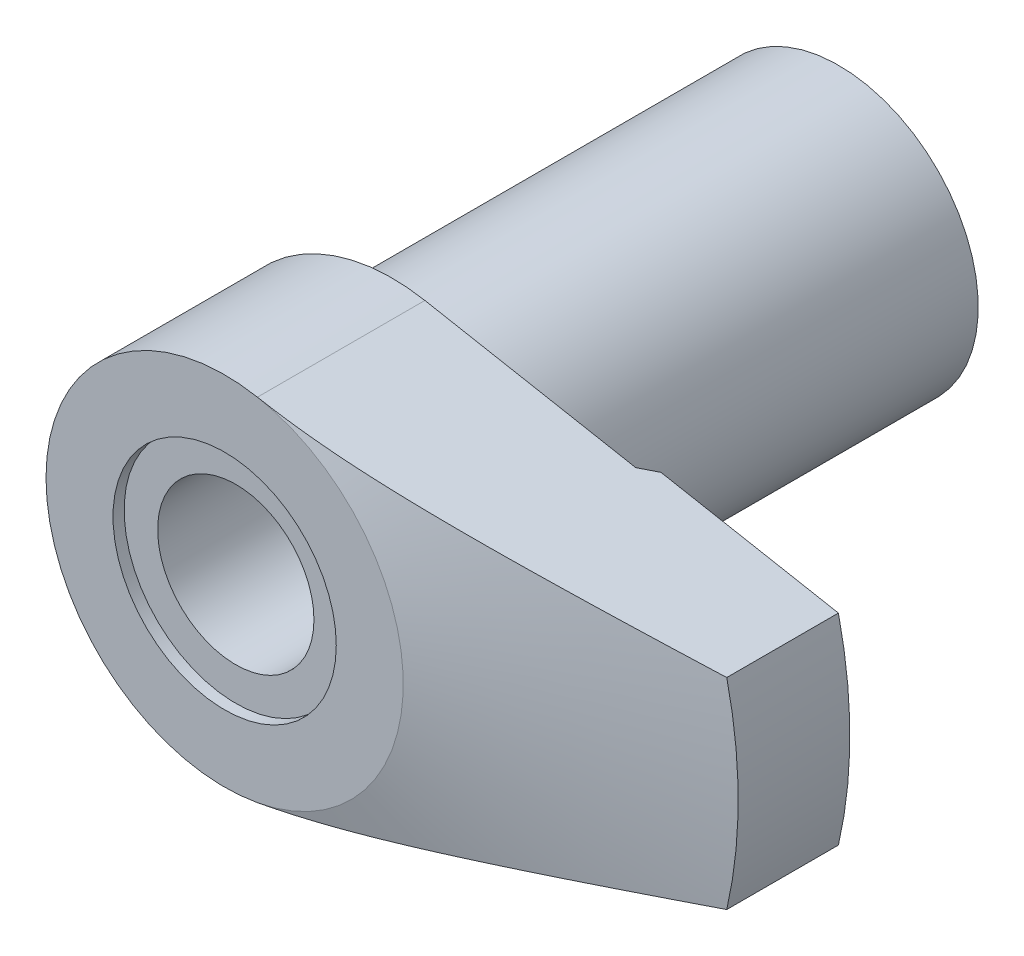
ISO-10303-21;
HEADER;
FILE_DESCRIPTION(('STEP AP214'),'2;1');
FILE_NAME('part.step','',(''),(''),'','','');
FILE_SCHEMA(('AUTOMOTIVE_DESIGN { 1 0 10303 214 1 1 1 1 }'));
ENDSEC;
DATA;
#1=APPLICATION_CONTEXT('core data for automotive mechanical design processes');
#2=APPLICATION_PROTOCOL_DEFINITION('international standard','automotive_design',2000,#1);
#3=PRODUCT_CONTEXT('',#1,'mechanical');
#4=PRODUCT('Part','Part','',(#3));
#5=PRODUCT_RELATED_PRODUCT_CATEGORY('part','',(#4));
#6=PRODUCT_DEFINITION_FORMATION('','',#4);
#7=PRODUCT_DEFINITION_CONTEXT('part definition',#1,'design');
#8=PRODUCT_DEFINITION('design','',#6,#7);
#9=PRODUCT_DEFINITION_SHAPE('','',#8);
#10=(LENGTH_UNIT() NAMED_UNIT(*) SI_UNIT(.MILLI.,.METRE.));
#11=(NAMED_UNIT(*) PLANE_ANGLE_UNIT() SI_UNIT($,.RADIAN.));
#12=(NAMED_UNIT(*) SI_UNIT($,.STERADIAN.) SOLID_ANGLE_UNIT());
#13=UNCERTAINTY_MEASURE_WITH_UNIT(LENGTH_MEASURE(1.E-05),#10,'distance_accuracy_value','');
#14=(GEOMETRIC_REPRESENTATION_CONTEXT(3) GLOBAL_UNCERTAINTY_ASSIGNED_CONTEXT((#13)) GLOBAL_UNIT_ASSIGNED_CONTEXT((#10,
#11,#12)) REPRESENTATION_CONTEXT('',''));
#15=CARTESIAN_POINT('',(0.,0.,0.));
#16=DIRECTION('',(0.,0.,1.));
#17=DIRECTION('',(1.,0.,0.));
#18=AXIS2_PLACEMENT_3D('',#15,#16,#17);
#19=CARTESIAN_POINT('',(38.9743505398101,9.,55.));
#20=DIRECTION('',(-0.183527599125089,-0.983014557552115,0.));
#21=DIRECTION('',(0.983014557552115,-0.183527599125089,0.));
#22=AXIS2_PLACEMENT_3D('',#19,#20,#21);
#23=PLANE('',#22);
#24=DIRECTION('',(0.983014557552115,-0.183527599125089,0.));
#25=VECTOR('',#24,1.);
#26=CARTESIAN_POINT('',(2.93644158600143,15.7282329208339,40.));
#27=LINE('',#26,#25);
#28=CARTESIAN_POINT('',(2.93644158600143,15.7282329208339,40.));
#29=VERTEX_POINT('',#28);
#30=CARTESIAN_POINT('',(21.8195346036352,12.2027828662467,40.));
#31=VERTEX_POINT('',#30);
#32=EDGE_CURVE('E73',#29,#31,#27,.T.);
#33=ORIENTED_EDGE('',*,*,#32,.F.);
#34=DIRECTION('',(0.,0.,-1.));
#35=VECTOR('',#34,1.);
#36=CARTESIAN_POINT('',(2.93644158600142,15.7282329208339,55.));
#37=LINE('',#36,#35);
#38=CARTESIAN_POINT('',(2.93644158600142,15.7282329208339,55.));
#39=VERTEX_POINT('',#38);
#40=EDGE_CURVE('E160',#39,#29,#37,.T.);
#41=ORIENTED_EDGE('',*,*,#40,.F.);
#42=CARTESIAN_POINT('',(2.93624158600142,15.7282702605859,54.9999999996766));
#43=CARTESIAN_POINT('',(3.27198005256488,15.6655883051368,55.0000135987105));
#44=CARTESIAN_POINT('',(3.60771690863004,15.6029066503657,54.9972684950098));
#45=CARTESIAN_POINT('',(4.27909896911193,15.4775604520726,54.9863525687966));
#46=CARTESIAN_POINT('',(4.61474417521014,15.4148959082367,54.9781818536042));
#47=CARTESIAN_POINT('',(5.28578738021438,15.2896129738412,54.9565089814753));
#48=CARTESIAN_POINT('',(5.62118541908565,15.2269945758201,54.9430081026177));
#49=CARTESIAN_POINT('',(6.29174105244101,15.1018026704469,54.910851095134));
#50=CARTESIAN_POINT('',(6.62689864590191,15.0392291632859,54.8921949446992));
#51=CARTESIAN_POINT('',(7.63088618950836,14.8517859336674,54.8288811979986));
#52=CARTESIAN_POINT('',(8.29927611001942,14.7269983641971,54.7768432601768));
#53=CARTESIAN_POINT('',(9.63452756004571,14.4777085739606,54.6552798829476));
#54=CARTESIAN_POINT('',(10.3013889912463,14.3532063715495,54.5857533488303));
#55=CARTESIAN_POINT('',(11.6317544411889,14.1048287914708,54.4318940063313));
#56=CARTESIAN_POINT('',(12.2952626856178,13.9809526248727,54.3475986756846));
#57=CARTESIAN_POINT('',(13.6206011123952,13.7335135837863,54.1664787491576));
#58=CARTESIAN_POINT('',(14.2824313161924,13.6099507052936,54.0696543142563));
#59=CARTESIAN_POINT('',(15.604824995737,13.3630614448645,53.8655820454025));
#60=CARTESIAN_POINT('',(16.2653877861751,13.2397351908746,53.7583296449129));
#61=CARTESIAN_POINT('',(17.5851193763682,12.9933429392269,53.5352726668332));
#62=CARTESIAN_POINT('',(18.244288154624,12.8702769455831,53.4194679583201));
#63=CARTESIAN_POINT('',(19.7431177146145,12.5904473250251,53.1479184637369));
#64=CARTESIAN_POINT('',(20.5823917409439,12.4337559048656,52.9899704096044));
#65=CARTESIAN_POINT('',(22.259269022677,12.1206849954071,52.6651711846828));
#66=CARTESIAN_POINT('',(23.0968722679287,11.9643055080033,52.4983199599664));
#67=CARTESIAN_POINT('',(24.7705715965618,11.6518279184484,52.1576412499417));
#68=CARTESIAN_POINT('',(25.6066678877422,11.4957297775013,51.9838148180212));
#69=CARTESIAN_POINT('',(27.2777257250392,11.1837453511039,51.6306071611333));
#70=CARTESIAN_POINT('',(28.1126872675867,11.0278590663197,51.4512259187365));
#71=CARTESIAN_POINT('',(29.7842993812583,10.7157711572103,51.0874381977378));
#72=CARTESIAN_POINT('',(30.6209469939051,10.5595700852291,50.903017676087));
#73=CARTESIAN_POINT('',(32.2934616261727,10.2473136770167,50.5305455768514));
#74=CARTESIAN_POINT('',(33.1293286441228,10.0912583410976,50.3424939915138));
#75=CARTESIAN_POINT('',(34.8004037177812,9.77927069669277,49.9634277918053));
#76=CARTESIAN_POINT('',(35.6356117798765,9.62333838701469,49.7724132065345));
#77=CARTESIAN_POINT('',(37.3054715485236,9.31157763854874,49.3879134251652));
#78=CARTESIAN_POINT('',(38.1401232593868,9.15574919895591,49.1944282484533));
#79=CARTESIAN_POINT('',(38.9745505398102,8.99996266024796,48.9999533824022));
#80=B_SPLINE_CURVE_WITH_KNOTS('',3,(#42,#43,#44,#45,#46,#47,#48,#49,#50,#51,#52,#53,#54,#55,#56,
#57,#58,#59,#60,#61,#62,#63,#64,#65,#66,#67,#68,#69,#70,#71,#72,#73,#74,#75,#76,#77,#78,#79),
.UNSPECIFIED.,.F.,.F.,(4,2,2,2,2,2,2,2,2,2,2,2,2,2,2,2,2,2,4),(0.,1.02460521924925,
2.04919017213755,3.07352959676,4.09787335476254,6.14337060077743,8.18899591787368,
10.2295034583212,12.2699847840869,14.3113637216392,16.3527739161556,18.9574987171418,
21.5622392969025,24.1665879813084,26.7709448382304,29.383501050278,31.9960628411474,
34.6085989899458,37.2211146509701),.UNSPECIFIED.);
#81=CARTESIAN_POINT('',(38.9743505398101,9.,49.));
#82=VERTEX_POINT('',#81);
#83=EDGE_CURVE('E135',#39,#82,#80,.T.);
#84=ORIENTED_EDGE('',*,*,#83,.T.);
#85=DIRECTION('',(0.,0.,-1.));
#86=VECTOR('',#85,1.);
#87=CARTESIAN_POINT('',(38.9743505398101,9.,55.));
#88=LINE('',#87,#86);
#89=CARTESIAN_POINT('',(38.9743505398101,9.,39.));
#90=VERTEX_POINT('',#89);
#91=EDGE_CURVE('E163',#82,#90,#88,.T.);
#92=ORIENTED_EDGE('',*,*,#91,.T.);
#93=DIRECTION('',(-0.983014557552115,0.183527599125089,0.));
#94=VECTOR('',#93,1.);
#95=CARTESIAN_POINT('',(38.9743505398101,9.,39.));
#96=LINE('',#95,#94);
#97=CARTESIAN_POINT('',(23.0822451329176,11.9670363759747,39.));
#98=VERTEX_POINT('',#97);
#99=EDGE_CURVE('E148',#90,#98,#96,.T.);
#100=ORIENTED_EDGE('',*,*,#99,.T.);
#101=CARTESIAN_POINT('',(-12.1892639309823,18.5521833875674,42.8017644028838));
#102=CARTESIAN_POINT('',(-11.9716131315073,18.5115482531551,42.9552352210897));
#103=CARTESIAN_POINT('',(-11.7531749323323,18.4707661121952,43.1075492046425));
#104=CARTESIAN_POINT('',(-11.3145923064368,18.3888832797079,43.4096307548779));
#105=CARTESIAN_POINT('',(-11.0944478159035,18.3477825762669,43.5593982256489));
#106=CARTESIAN_POINT('',(-10.4310764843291,18.2239319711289,44.0046527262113));
#107=CARTESIAN_POINT('',(-9.98511427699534,18.1406713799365,44.2959484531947));
#108=CARTESIAN_POINT('',(-9.07888967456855,17.9714803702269,44.8687270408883));
#109=CARTESIAN_POINT('',(-8.61851605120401,17.8855291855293,45.1500284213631));
#110=CARTESIAN_POINT('',(-7.68806849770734,17.7118157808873,45.6954613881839));
#111=CARTESIAN_POINT('',(-7.21799577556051,17.6240537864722,45.9595950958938));
#112=CARTESIAN_POINT('',(-6.25356224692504,17.4439952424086,46.4737867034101));
#113=CARTESIAN_POINT('',(-5.75888985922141,17.3516405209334,46.7232441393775));
#114=CARTESIAN_POINT('',(-4.75666121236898,17.1645256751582,47.1943149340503));
#115=CARTESIAN_POINT('',(-4.24910261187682,17.0697651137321,47.4159231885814));
#116=CARTESIAN_POINT('',(-3.22328192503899,16.8782456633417,47.8234099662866));
#117=CARTESIAN_POINT('',(-2.70509080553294,16.7815000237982,48.0094715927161));
#118=CARTESIAN_POINT('',(-1.65600675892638,16.5856373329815,48.3395993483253));
#119=CARTESIAN_POINT('',(-1.12512218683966,16.486521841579,48.4836923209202));
#120=CARTESIAN_POINT('',(-0.333478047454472,16.3387228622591,48.6598476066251));
#121=CARTESIAN_POINT('',(-0.0767622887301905,16.2907943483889,48.7110738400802));
#122=CARTESIAN_POINT('',(0.438688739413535,16.1945602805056,48.8015554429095));
#123=CARTESIAN_POINT('',(0.697423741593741,16.1462547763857,48.8408123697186));
#124=CARTESIAN_POINT('',(1.21654205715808,16.0493360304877,48.9067562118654));
#125=CARTESIAN_POINT('',(1.47692596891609,16.000722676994,48.933438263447));
#126=CARTESIAN_POINT('',(1.99867646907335,15.903312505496,48.9737701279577));
#127=CARTESIAN_POINT('',(2.26004306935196,15.8545156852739,48.9874197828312));
#128=CARTESIAN_POINT('',(2.77969423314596,15.7574974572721,49.0013585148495));
#129=CARTESIAN_POINT('',(3.03797431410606,15.7092768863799,49.0018202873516));
#130=CARTESIAN_POINT('',(3.55427147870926,15.6128848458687,48.9898133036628));
#131=CARTESIAN_POINT('',(3.81228852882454,15.5647133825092,48.9773430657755));
#132=CARTESIAN_POINT('',(4.32739660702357,15.4685433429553,48.9396786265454));
#133=CARTESIAN_POINT('',(4.58448772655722,15.4205447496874,48.9144857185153));
#134=CARTESIAN_POINT('',(5.0972267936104,15.3248170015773,48.8517917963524));
#135=CARTESIAN_POINT('',(5.35287455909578,15.2770878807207,48.8142892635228));
#136=CARTESIAN_POINT('',(6.11354932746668,15.1350708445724,48.6847083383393));
#137=CARTESIAN_POINT('',(6.61579008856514,15.0413031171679,48.5752881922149));
#138=CARTESIAN_POINT('',(7.60986358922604,14.8557108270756,48.31579057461));
#139=CARTESIAN_POINT('',(8.10169532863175,14.7638864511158,48.1657092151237));
#140=CARTESIAN_POINT('',(8.83269046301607,14.6274105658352,47.9142591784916));
#141=CARTESIAN_POINT('',(9.07619164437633,14.581949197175,47.8256459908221));
#142=CARTESIAN_POINT('',(9.5602738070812,14.4915716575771,47.6404944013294));
#143=CARTESIAN_POINT('',(9.80085477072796,14.4466554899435,47.5439559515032));
#144=CARTESIAN_POINT('',(10.2790455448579,14.3573778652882,47.3437280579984));
#145=CARTESIAN_POINT('',(10.5166560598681,14.3130162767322,47.2400403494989));
#146=CARTESIAN_POINT('',(10.9890224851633,14.2248260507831,47.0261849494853));
#147=CARTESIAN_POINT('',(11.2237784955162,14.1809973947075,46.9160174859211));
#148=CARTESIAN_POINT('',(11.9748909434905,14.0407656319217,46.5520620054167));
#149=CARTESIAN_POINT('',(12.4859028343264,13.9453603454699,46.2868093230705));
#150=CARTESIAN_POINT('',(13.4958766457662,13.7567994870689,45.7334260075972));
#151=CARTESIAN_POINT('',(13.9948347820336,13.6636446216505,45.4452883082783));
#152=CARTESIAN_POINT('',(14.9826537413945,13.4792200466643,44.8504305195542));
#153=CARTESIAN_POINT('',(15.4715024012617,13.3879526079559,44.5436896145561));
#154=CARTESIAN_POINT('',(16.4398875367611,13.20715630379,43.9155277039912));
#155=CARTESIAN_POINT('',(16.9194249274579,13.1176272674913,43.5941081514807));
#156=CARTESIAN_POINT('',(17.8724548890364,12.9396977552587,42.9379831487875));
#157=CARTESIAN_POINT('',(18.3459149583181,12.8513033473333,42.6032289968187));
#158=CARTESIAN_POINT('',(19.2859224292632,12.6758051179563,41.9238290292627));
#159=CARTESIAN_POINT('',(19.7524696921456,12.5887013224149,41.5791830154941));
#160=CARTESIAN_POINT('',(20.6793255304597,12.4156584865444,40.8819058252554));
#161=CARTESIAN_POINT('',(21.1396376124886,12.3297187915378,40.5292794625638));
#162=CARTESIAN_POINT('',(22.0551055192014,12.1588020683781,39.817186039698));
#163=CARTESIAN_POINT('',(22.5102613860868,12.073825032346,39.4577190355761));
#164=CARTESIAN_POINT('',(23.4191540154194,11.904135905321,38.7305660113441));
#165=CARTESIAN_POINT('',(23.8728605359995,11.8194294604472,38.3628409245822));
#166=CARTESIAN_POINT('',(24.7763269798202,11.6507533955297,37.6224117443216));
#167=CARTESIAN_POINT('',(25.2260868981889,11.5667837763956,37.2497076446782));
#168=CARTESIAN_POINT('',(26.1222046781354,11.3994796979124,36.4999918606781));
#169=CARTESIAN_POINT('',(26.5685621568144,11.3161453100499,36.1229797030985));
#170=CARTESIAN_POINT('',(27.4582431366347,11.1500429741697,35.36526672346));
#171=CARTESIAN_POINT('',(27.9015666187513,11.0672750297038,34.9845658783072));
#172=CARTESIAN_POINT('',(29.2256635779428,10.8200677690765,33.839294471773));
#173=CARTESIAN_POINT('',(30.1024586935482,10.6563712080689,33.0699624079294));
#174=CARTESIAN_POINT('',(31.8476403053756,10.3305479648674,31.5215859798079));
#175=CARTESIAN_POINT('',(32.7160271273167,10.1684212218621,30.7425419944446));
#176=CARTESIAN_POINT('',(34.1376419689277,9.90300749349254,29.4559211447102));
#177=CARTESIAN_POINT('',(34.6928404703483,9.79935262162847,28.9505938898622));
#178=CARTESIAN_POINT('',(35.8009983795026,9.59246091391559,27.9370012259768));
#179=CARTESIAN_POINT('',(36.3539569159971,9.48922424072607,27.4287348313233));
#180=CARTESIAN_POINT('',(37.4533505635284,9.28396880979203,26.4138531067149));
#181=CARTESIAN_POINT('',(37.9998025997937,9.18194689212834,25.9072567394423));
#182=CARTESIAN_POINT('',(39.0906416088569,8.97828860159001,24.8921704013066));
#183=CARTESIAN_POINT('',(39.6350292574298,8.876652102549,24.383681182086));
#184=CARTESIAN_POINT('',(40.1786023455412,8.77516768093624,23.8742944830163));
#185=B_SPLINE_CURVE_WITH_KNOTS('',3,(#101,#102,#103,#104,#105,#106,#107,#108,#109,#110,#111,
#112,#113,#114,#115,#116,#117,#118,#119,#120,#121,#122,#123,#124,#125,#126,#127,#128,#129,#130,
#131,#132,#133,#134,#135,#136,#137,#138,#139,#140,#141,#142,#143,#144,#145,#146,#147,#148,#149,
#150,#151,#152,#153,#154,#155,#156,#157,#158,#159,#160,#161,#162,#163,#164,#165,#166,#167,#168,
#169,#170,#171,#172,#173,#174,#175,#176,#177,#178,#179,#180,#181,#182,#183,#184),.UNSPECIFIED.,
.F.,.F.,(4,2,2,2,2,2,2,2,2,2,2,2,2,2,2,2,2,2,2,2,2,2,2,2,2,2,2,2,2,2,2,2,2,2,2,2,2,2,2,2,2,4),
(0.,0.808193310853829,1.61641699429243,3.23361712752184,4.87227459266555,6.51072918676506,
8.19501852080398,9.87961610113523,11.5552872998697,13.2298843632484,14.0280401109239,
14.8260919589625,15.6244522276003,16.4228221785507,17.2107326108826,17.9987333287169,
18.7866539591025,19.5746718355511,21.1400909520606,22.7056598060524,23.4947914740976,
24.2839279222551,25.0728735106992,25.8617913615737,27.6117951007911,29.3623413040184,
31.1148837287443,32.8672530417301,34.6267466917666,36.3862756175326,38.1447700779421,
39.9032501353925,41.6735824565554,43.443916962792,45.2144478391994,46.9849898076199,
50.5185726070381,54.0520179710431,56.3255762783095,58.5999472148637,60.8562493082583,
63.1117348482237),.UNSPECIFIED.);
#186=EDGE_CURVE('E28',#31,#98,#185,.T.);
#187=ORIENTED_EDGE('',*,*,#186,.F.);
#188=EDGE_LOOP('',(#33,#41,#84,#92,#100,#187));
#189=FACE_BOUND('',#188,.T.);
#190=ADVANCED_FACE('F14',(#189),#23,.F.);
#191=CARTESIAN_POINT('',(38.9743505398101,-9.,55.));
#192=DIRECTION('',(0.183527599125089,-0.983014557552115,0.));
#193=DIRECTION('',(0.983014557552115,0.183527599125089,0.));
#194=AXIS2_PLACEMENT_3D('',#191,#192,#193);
#195=PLANE('',#194);
#196=DIRECTION('',(0.,0.,-1.));
#197=VECTOR('',#196,1.);
#198=CARTESIAN_POINT('',(2.93644158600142,-15.7282329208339,55.));
#199=LINE('',#198,#197);
#200=CARTESIAN_POINT('',(2.93644158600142,-15.7282329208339,55.));
#201=VERTEX_POINT('',#200);
#202=CARTESIAN_POINT('',(2.93644158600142,-15.7282329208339,40.));
#203=VERTEX_POINT('',#202);
#204=EDGE_CURVE('E85',#201,#203,#199,.T.);
#205=ORIENTED_EDGE('',*,*,#204,.T.);
#206=DIRECTION('',(-0.983014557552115,-0.18352759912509,0.));
#207=VECTOR('',#206,1.);
#208=CARTESIAN_POINT('',(21.8195346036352,-12.2027828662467,40.));
#209=LINE('',#208,#207);
#210=CARTESIAN_POINT('',(21.8195346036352,-12.2027828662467,40.));
#211=VERTEX_POINT('',#210);
#212=EDGE_CURVE('E70',#211,#203,#209,.T.);
#213=ORIENTED_EDGE('',*,*,#212,.F.);
#214=CARTESIAN_POINT('',(-12.1892639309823,-18.5521833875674,42.8017644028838));
#215=CARTESIAN_POINT('',(-11.9716131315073,-18.5115482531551,42.9552352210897));
#216=CARTESIAN_POINT('',(-11.7531749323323,-18.4707661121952,43.1075492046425));
#217=CARTESIAN_POINT('',(-11.3145923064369,-18.3888832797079,43.4096307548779));
#218=CARTESIAN_POINT('',(-11.0944478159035,-18.3477825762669,43.5593982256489));
#219=CARTESIAN_POINT('',(-10.4310764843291,-18.2239319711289,44.0046527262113));
#220=CARTESIAN_POINT('',(-9.98511427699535,-18.1406713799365,44.2959484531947));
#221=CARTESIAN_POINT('',(-9.07888967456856,-17.9714803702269,44.8687270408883));
#222=CARTESIAN_POINT('',(-8.61851605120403,-17.8855291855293,45.1500284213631));
#223=CARTESIAN_POINT('',(-7.68806849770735,-17.7118157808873,45.6954613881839));
#224=CARTESIAN_POINT('',(-7.21799577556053,-17.6240537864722,45.9595950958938));
#225=CARTESIAN_POINT('',(-6.25356224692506,-17.4439952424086,46.4737867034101));
#226=CARTESIAN_POINT('',(-5.75888985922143,-17.3516405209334,46.7232441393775));
#227=CARTESIAN_POINT('',(-4.756661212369,-17.1645256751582,47.1943149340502));
#228=CARTESIAN_POINT('',(-4.24910261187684,-17.0697651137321,47.4159231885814));
#229=CARTESIAN_POINT('',(-3.22328192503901,-16.8782456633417,47.8234099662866));
#230=CARTESIAN_POINT('',(-2.70509080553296,-16.7815000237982,48.0094715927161));
#231=CARTESIAN_POINT('',(-1.6560067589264,-16.5856373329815,48.3395993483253));
#232=CARTESIAN_POINT('',(-1.12512218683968,-16.486521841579,48.4836923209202));
#233=CARTESIAN_POINT('',(-0.333478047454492,-16.3387228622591,48.6598476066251));
#234=CARTESIAN_POINT('',(-0.076762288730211,-16.2907943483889,48.7110738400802));
#235=CARTESIAN_POINT('',(0.438688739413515,-16.1945602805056,48.8015554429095));
#236=CARTESIAN_POINT('',(0.697423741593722,-16.1462547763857,48.8408123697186));
#237=CARTESIAN_POINT('',(1.21654205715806,-16.0493360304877,48.9067562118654));
#238=CARTESIAN_POINT('',(1.47692596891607,-16.000722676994,48.933438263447));
#239=CARTESIAN_POINT('',(1.99867646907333,-15.903312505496,48.9737701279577));
#240=CARTESIAN_POINT('',(2.26004306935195,-15.8545156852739,48.9874197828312));
#241=CARTESIAN_POINT('',(2.77969423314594,-15.7574974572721,49.0013585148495));
#242=CARTESIAN_POINT('',(3.03797431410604,-15.7092768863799,49.0018202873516));
#243=CARTESIAN_POINT('',(3.55427147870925,-15.6128848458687,48.9898133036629));
#244=CARTESIAN_POINT('',(3.81228852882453,-15.5647133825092,48.9773430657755));
#245=CARTESIAN_POINT('',(4.32739660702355,-15.4685433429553,48.9396786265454));
#246=CARTESIAN_POINT('',(4.5844877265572,-15.4205447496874,48.9144857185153));
#247=CARTESIAN_POINT('',(5.09722679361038,-15.3248170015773,48.8517917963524));
#248=CARTESIAN_POINT('',(5.35287455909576,-15.2770878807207,48.8142892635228));
#249=CARTESIAN_POINT('',(6.11354932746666,-15.1350708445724,48.6847083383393));
#250=CARTESIAN_POINT('',(6.61579008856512,-15.0413031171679,48.5752881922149));
#251=CARTESIAN_POINT('',(7.60986358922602,-14.8557108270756,48.31579057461));
#252=CARTESIAN_POINT('',(8.10169532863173,-14.7638864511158,48.1657092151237));
#253=CARTESIAN_POINT('',(8.83269046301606,-14.6274105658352,47.9142591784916));
#254=CARTESIAN_POINT('',(9.07619164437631,-14.581949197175,47.8256459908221));
#255=CARTESIAN_POINT('',(9.56027380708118,-14.4915716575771,47.6404944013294));
#256=CARTESIAN_POINT('',(9.80085477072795,-14.4466554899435,47.5439559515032));
#257=CARTESIAN_POINT('',(10.2790455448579,-14.3573778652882,47.3437280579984));
#258=CARTESIAN_POINT('',(10.5166560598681,-14.3130162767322,47.2400403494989));
#259=CARTESIAN_POINT('',(10.9890224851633,-14.2248260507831,47.0261849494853));
#260=CARTESIAN_POINT('',(11.2237784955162,-14.1809973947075,46.9160174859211));
#261=CARTESIAN_POINT('',(11.9748909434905,-14.0407656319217,46.5520620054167));
#262=CARTESIAN_POINT('',(12.4859028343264,-13.9453603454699,46.2868093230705));
#263=CARTESIAN_POINT('',(13.4958766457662,-13.7567994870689,45.7334260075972));
#264=CARTESIAN_POINT('',(13.9948347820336,-13.6636446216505,45.4452883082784));
#265=CARTESIAN_POINT('',(14.9826537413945,-13.4792200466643,44.8504305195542));
#266=CARTESIAN_POINT('',(15.4715024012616,-13.3879526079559,44.5436896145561));
#267=CARTESIAN_POINT('',(16.4398875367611,-13.20715630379,43.9155277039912));
#268=CARTESIAN_POINT('',(16.9194249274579,-13.1176272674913,43.5941081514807));
#269=CARTESIAN_POINT('',(17.8724548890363,-12.9396977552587,42.9379831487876));
#270=CARTESIAN_POINT('',(18.3459149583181,-12.8513033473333,42.6032289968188));
#271=CARTESIAN_POINT('',(19.2859224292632,-12.6758051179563,41.9238290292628));
#272=CARTESIAN_POINT('',(19.7524696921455,-12.5887013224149,41.5791830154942));
#273=CARTESIAN_POINT('',(20.6793255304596,-12.4156584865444,40.8819058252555));
#274=CARTESIAN_POINT('',(21.1396376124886,-12.3297187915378,40.5292794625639));
#275=CARTESIAN_POINT('',(22.0551055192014,-12.1588020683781,39.817186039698));
#276=CARTESIAN_POINT('',(22.5102613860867,-12.0738250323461,39.4577190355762));
#277=CARTESIAN_POINT('',(23.4191540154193,-11.9041359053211,38.7305660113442));
#278=CARTESIAN_POINT('',(23.8728605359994,-11.8194294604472,38.3628409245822));
#279=CARTESIAN_POINT('',(24.7763269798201,-11.6507533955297,37.6224117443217));
#280=CARTESIAN_POINT('',(25.2260868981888,-11.5667837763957,37.2497076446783));
#281=CARTESIAN_POINT('',(26.1222046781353,-11.3994796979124,36.4999918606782));
#282=CARTESIAN_POINT('',(26.5685621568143,-11.3161453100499,36.1229797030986));
#283=CARTESIAN_POINT('',(27.4582431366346,-11.1500429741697,35.3652667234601));
#284=CARTESIAN_POINT('',(27.9015666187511,-11.0672750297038,34.9845658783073));
#285=CARTESIAN_POINT('',(29.2256635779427,-10.8200677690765,33.8392944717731));
#286=CARTESIAN_POINT('',(30.102458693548,-10.6563712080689,33.0699624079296));
#287=CARTESIAN_POINT('',(31.8476403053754,-10.3305479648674,31.521585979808));
#288=CARTESIAN_POINT('',(32.7160271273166,-10.1684212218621,30.7425419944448));
#289=CARTESIAN_POINT('',(34.1376419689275,-9.90300749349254,29.4559211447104));
#290=CARTESIAN_POINT('',(34.6928404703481,-9.79935262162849,28.9505938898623));
#291=CARTESIAN_POINT('',(35.8009983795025,-9.59246091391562,27.9370012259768));
#292=CARTESIAN_POINT('',(36.353956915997,-9.48922424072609,27.4287348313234));
#293=CARTESIAN_POINT('',(37.4533505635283,-9.28396880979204,26.413853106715));
#294=CARTESIAN_POINT('',(37.9998025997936,-9.18194689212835,25.9072567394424));
#295=CARTESIAN_POINT('',(39.0906416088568,-8.97828860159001,24.8921704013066));
#296=CARTESIAN_POINT('',(39.6350292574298,-8.876652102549,24.383681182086));
#297=CARTESIAN_POINT('',(40.1786023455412,-8.77516768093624,23.8742944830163));
#298=B_SPLINE_CURVE_WITH_KNOTS('',3,(#214,#215,#216,#217,#218,#219,#220,#221,#222,#223,#224,
#225,#226,#227,#228,#229,#230,#231,#232,#233,#234,#235,#236,#237,#238,#239,#240,#241,#242,#243,
#244,#245,#246,#247,#248,#249,#250,#251,#252,#253,#254,#255,#256,#257,#258,#259,#260,#261,#262,
#263,#264,#265,#266,#267,#268,#269,#270,#271,#272,#273,#274,#275,#276,#277,#278,#279,#280,#281,
#282,#283,#284,#285,#286,#287,#288,#289,#290,#291,#292,#293,#294,#295,#296,#297),.UNSPECIFIED.,
.F.,.F.,(4,2,2,2,2,2,2,2,2,2,2,2,2,2,2,2,2,2,2,2,2,2,2,2,2,2,2,2,2,2,2,2,2,2,2,2,2,2,2,2,2,4),
(0.,0.808193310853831,1.61641699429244,3.23361712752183,4.87227459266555,6.51072918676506,
8.19501852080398,9.87961610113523,11.5552872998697,13.2298843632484,14.0280401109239,
14.8260919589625,15.6244522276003,16.4228221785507,17.2107326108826,17.9987333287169,
18.7866539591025,19.5746718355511,21.1400909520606,22.7056598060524,23.4947914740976,
24.2839279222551,25.0728735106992,25.8617913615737,27.6117951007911,29.3623413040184,
31.1148837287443,32.8672530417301,34.6267466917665,36.3862756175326,38.144770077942,
39.9032501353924,41.6735824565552,43.4439169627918,45.2144478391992,46.9849898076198,
50.5185726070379,54.0520179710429,56.3255762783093,58.5999472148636,60.8562493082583,
63.1117348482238),.UNSPECIFIED.);
#299=CARTESIAN_POINT('',(23.0822451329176,-11.9670363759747,39.));
#300=VERTEX_POINT('',#299);
#301=EDGE_CURVE('E75',#211,#300,#298,.T.);
#302=ORIENTED_EDGE('',*,*,#301,.T.);
#303=DIRECTION('',(-0.983014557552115,-0.183527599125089,0.));
#304=VECTOR('',#303,1.);
#305=CARTESIAN_POINT('',(38.9743505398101,-9.,39.));
#306=LINE('',#305,#304);
#307=CARTESIAN_POINT('',(38.9743505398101,-9.,39.));
#308=VERTEX_POINT('',#307);
#309=EDGE_CURVE('E164',#308,#300,#306,.T.);
#310=ORIENTED_EDGE('',*,*,#309,.F.);
#311=DIRECTION('',(0.,0.,-1.));
#312=VECTOR('',#311,1.);
#313=CARTESIAN_POINT('',(38.9743505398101,-9.,55.));
#314=LINE('',#313,#312);
#315=CARTESIAN_POINT('',(38.9743505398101,-9.,49.));
#316=VERTEX_POINT('',#315);
#317=EDGE_CURVE('E36',#316,#308,#314,.T.);
#318=ORIENTED_EDGE('',*,*,#317,.F.);
#319=CARTESIAN_POINT('',(2.93624158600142,-15.7282702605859,54.9999999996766));
#320=CARTESIAN_POINT('',(3.27198005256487,-15.6655883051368,55.0000135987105));
#321=CARTESIAN_POINT('',(3.60771690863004,-15.6029066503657,54.9972684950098));
#322=CARTESIAN_POINT('',(4.27909896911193,-15.4775604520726,54.9863525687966));
#323=CARTESIAN_POINT('',(4.61474417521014,-15.4148959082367,54.9781818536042));
#324=CARTESIAN_POINT('',(5.28578738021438,-15.2896129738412,54.9565089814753));
#325=CARTESIAN_POINT('',(5.62118541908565,-15.2269945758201,54.9430081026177));
#326=CARTESIAN_POINT('',(6.29174105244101,-15.1018026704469,54.910851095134));
#327=CARTESIAN_POINT('',(6.62689864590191,-15.0392291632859,54.8921949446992));
#328=CARTESIAN_POINT('',(7.63088618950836,-14.8517859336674,54.8288811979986));
#329=CARTESIAN_POINT('',(8.29927611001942,-14.7269983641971,54.7768432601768));
#330=CARTESIAN_POINT('',(9.63452756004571,-14.4777085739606,54.6552798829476));
#331=CARTESIAN_POINT('',(10.3013889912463,-14.3532063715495,54.5857533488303));
#332=CARTESIAN_POINT('',(11.6317544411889,-14.1048287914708,54.4318940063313));
#333=CARTESIAN_POINT('',(12.2952626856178,-13.9809526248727,54.3475986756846));
#334=CARTESIAN_POINT('',(13.6206011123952,-13.7335135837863,54.1664787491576));
#335=CARTESIAN_POINT('',(14.2824313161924,-13.6099507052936,54.0696543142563));
#336=CARTESIAN_POINT('',(15.604824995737,-13.3630614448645,53.8655820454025));
#337=CARTESIAN_POINT('',(16.2653877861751,-13.2397351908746,53.7583296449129));
#338=CARTESIAN_POINT('',(17.5851193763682,-12.9933429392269,53.5352726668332));
#339=CARTESIAN_POINT('',(18.244288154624,-12.8702769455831,53.4194679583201));
#340=CARTESIAN_POINT('',(19.7431177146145,-12.5904473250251,53.1479184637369));
#341=CARTESIAN_POINT('',(20.5823917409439,-12.4337559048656,52.9899704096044));
#342=CARTESIAN_POINT('',(22.259269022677,-12.1206849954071,52.6651711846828));
#343=CARTESIAN_POINT('',(23.0968722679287,-11.9643055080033,52.4983199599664));
#344=CARTESIAN_POINT('',(24.7705715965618,-11.6518279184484,52.1576412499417));
#345=CARTESIAN_POINT('',(25.6066678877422,-11.4957297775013,51.9838148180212));
#346=CARTESIAN_POINT('',(27.2777257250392,-11.1837453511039,51.6306071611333));
#347=CARTESIAN_POINT('',(28.1126872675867,-11.0278590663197,51.4512259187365));
#348=CARTESIAN_POINT('',(29.7842993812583,-10.7157711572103,51.0874381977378));
#349=CARTESIAN_POINT('',(30.6209469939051,-10.5595700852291,50.903017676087));
#350=CARTESIAN_POINT('',(32.2934616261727,-10.2473136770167,50.5305455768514));
#351=CARTESIAN_POINT('',(33.1293286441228,-10.0912583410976,50.3424939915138));
#352=CARTESIAN_POINT('',(34.8004037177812,-9.77927069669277,49.9634277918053));
#353=CARTESIAN_POINT('',(35.6356117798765,-9.62333838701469,49.7724132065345));
#354=CARTESIAN_POINT('',(37.3054715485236,-9.31157763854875,49.3879134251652));
#355=CARTESIAN_POINT('',(38.1401232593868,-9.15574919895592,49.1944282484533));
#356=CARTESIAN_POINT('',(38.9745505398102,-8.99996266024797,48.9999533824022));
#357=B_SPLINE_CURVE_WITH_KNOTS('',3,(#319,#320,#321,#322,#323,#324,#325,#326,#327,#328,#329,
#330,#331,#332,#333,#334,#335,#336,#337,#338,#339,#340,#341,#342,#343,#344,#345,#346,#347,#348,
#349,#350,#351,#352,#353,#354,#355,#356),.UNSPECIFIED.,.F.,.F.,(4,2,2,2,2,2,2,2,2,2,2,2,2,2,2,2,
2,2,4),(0.,1.02460521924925,2.04919017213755,3.07352959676,4.09787335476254,6.14337060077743,
8.18899591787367,10.2295034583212,12.2699847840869,14.3113637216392,16.3527739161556,
18.9574987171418,21.5622392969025,24.1665879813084,26.7709448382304,29.383501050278,
31.9960628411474,34.6085989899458,37.22111465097),.UNSPECIFIED.);
#358=EDGE_CURVE('E22',#201,#316,#357,.T.);
#359=ORIENTED_EDGE('',*,*,#358,.F.);
#360=EDGE_LOOP('',(#205,#213,#302,#310,#318,#359));
#361=FACE_BOUND('',#360,.T.);
#362=ADVANCED_FACE('F80',(#361),#195,.T.);
#363=CARTESIAN_POINT('',(0.,0.,55.));
#364=DIRECTION('',(0.,0.,-1.));
#365=DIRECTION('',(-1.,0.,0.));
#366=AXIS2_PLACEMENT_3D('',#363,#364,#365);
#367=CYLINDRICAL_SURFACE('',#366,16.);
#368=CARTESIAN_POINT('',(0.,0.,40.));
#369=DIRECTION('',(0.,0.,-1.));
#370=DIRECTION('',(-1.,0.,0.));
#371=AXIS2_PLACEMENT_3D('',#368,#369,#370);
#372=CIRCLE('',#371,16.);
#373=EDGE_CURVE('E86',#203,#29,#372,.T.);
#374=ORIENTED_EDGE('',*,*,#373,.F.);
#375=ORIENTED_EDGE('',*,*,#204,.F.);
#376=CARTESIAN_POINT('',(0.,0.,55.));
#377=DIRECTION('',(0.,0.,1.));
#378=DIRECTION('',(1.,0.,0.));
#379=AXIS2_PLACEMENT_3D('',#376,#377,#378);
#380=CIRCLE('',#379,16.);
#381=EDGE_CURVE('E156',#39,#201,#380,.T.);
#382=ORIENTED_EDGE('',*,*,#381,.F.);
#383=ORIENTED_EDGE('',*,*,#40,.T.);
#384=EDGE_LOOP('',(#374,#375,#382,#383));
#385=FACE_BOUND('',#384,.T.);
#386=ADVANCED_FACE('F203',(#385),#367,.T.);
#387=CARTESIAN_POINT('',(50.,20.,39.));
#388=DIRECTION('',(0.,0.,1.));
#389=DIRECTION('',(1.,0.,0.));
#390=AXIS2_PLACEMENT_3D('',#387,#388,#389);
#391=PLANE('',#390);
#392=CARTESIAN_POINT('',(0.,0.,39.));
#393=DIRECTION('',(0.,0.,1.));
#394=DIRECTION('',(1.,0.,0.));
#395=AXIS2_PLACEMENT_3D('',#392,#393,#394);
#396=CIRCLE('',#395,26.);
#397=EDGE_CURVE('E9',#98,#300,#396,.F.);
#398=ORIENTED_EDGE('',*,*,#397,.F.);
#399=ORIENTED_EDGE('',*,*,#99,.F.);
#400=CARTESIAN_POINT('',(0.,0.,39.));
#401=DIRECTION('',(0.,0.,1.));
#402=DIRECTION('',(1.,0.,0.));
#403=AXIS2_PLACEMENT_3D('',#400,#401,#402);
#404=CIRCLE('',#403,40.);
#405=EDGE_CURVE('E151',#308,#90,#404,.T.);
#406=ORIENTED_EDGE('',*,*,#405,.F.);
#407=ORIENTED_EDGE('',*,*,#309,.T.);
#408=EDGE_LOOP('',(#398,#399,#406,#407));
#409=FACE_BOUND('',#408,.T.);
#410=ADVANCED_FACE('F282',(#409),#391,.F.);
#411=CARTESIAN_POINT('',(0.,0.,55.));
#412=DIRECTION('',(0.,0.,-1.));
#413=DIRECTION('',(-1.,0.,0.));
#414=AXIS2_PLACEMENT_3D('',#411,#412,#413);
#415=CYLINDRICAL_SURFACE('',#414,7.);
#416=CARTESIAN_POINT('',(0.,0.,0.));
#417=DIRECTION('',(0.,0.,1.));
#418=DIRECTION('',(1.,0.,0.));
#419=AXIS2_PLACEMENT_3D('',#416,#417,#418);
#420=CIRCLE('',#419,7.);
#421=CARTESIAN_POINT('',(7.,0.,0.));
#422=VERTEX_POINT('',#421);
#423=EDGE_CURVE('E153',#422,#422,#420,.T.);
#424=ORIENTED_EDGE('',*,*,#423,.F.);
#425=EDGE_LOOP('',(#424));
#426=FACE_BOUND('',#425,.T.);
#427=CARTESIAN_POINT('',(0.,0.,54.));
#428=DIRECTION('',(0.,0.,1.));
#429=DIRECTION('',(1.,0.,0.));
#430=AXIS2_PLACEMENT_3D('',#427,#428,#429);
#431=CIRCLE('',#430,7.);
#432=CARTESIAN_POINT('',(7.,0.,54.));
#433=VERTEX_POINT('',#432);
#434=EDGE_CURVE('E171',#433,#433,#431,.T.);
#435=ORIENTED_EDGE('',*,*,#434,.T.);
#436=EDGE_LOOP('',(#435));
#437=FACE_BOUND('',#436,.T.);
#438=ADVANCED_FACE('F194',(#426,#437),#415,.F.);
#439=CARTESIAN_POINT('',(0.,0.,0.));
#440=DIRECTION('',(0.,0.,1.));
#441=DIRECTION('',(1.,0.,0.));
#442=AXIS2_PLACEMENT_3D('',#439,#440,#441);
#443=PLANE('',#442);
#444=ORIENTED_EDGE('',*,*,#423,.T.);
#445=EDGE_LOOP('',(#444));
#446=FACE_BOUND('',#445,.T.);
#447=CARTESIAN_POINT('',(0.,0.,0.));
#448=DIRECTION('',(0.,0.,-1.));
#449=DIRECTION('',(-1.,0.,0.));
#450=AXIS2_PLACEMENT_3D('',#447,#448,#449);
#451=CIRCLE('',#450,12.5);
#452=CARTESIAN_POINT('',(-12.5,0.,0.));
#453=VERTEX_POINT('',#452);
#454=EDGE_CURVE('E143',#453,#453,#451,.T.);
#455=ORIENTED_EDGE('',*,*,#454,.T.);
#456=EDGE_LOOP('',(#455));
#457=FACE_BOUND('',#456,.T.);
#458=ADVANCED_FACE('F186',(#446,#457),#443,.F.);
#459=CARTESIAN_POINT('',(0.,0.,55.));
#460=DIRECTION('',(0.,0.,1.));
#461=DIRECTION('',(1.,0.,0.));
#462=AXIS2_PLACEMENT_3D('',#459,#460,#461);
#463=PLANE('',#462);
#464=CARTESIAN_POINT('',(0.,0.,55.));
#465=DIRECTION('',(0.,0.,1.));
#466=DIRECTION('',(1.,0.,0.));
#467=AXIS2_PLACEMENT_3D('',#464,#465,#466);
#468=CIRCLE('',#467,10.);
#469=CARTESIAN_POINT('',(10.,0.,55.));
#470=VERTEX_POINT('',#469);
#471=EDGE_CURVE('E91',#470,#470,#468,.T.);
#472=ORIENTED_EDGE('',*,*,#471,.F.);
#473=EDGE_LOOP('',(#472));
#474=FACE_BOUND('',#473,.T.);
#475=CARTESIAN_POINT('',(0.,0.,55.));
#476=DIRECTION('',(0.,0.,1.));
#477=DIRECTION('',(1.,0.,0.));
#478=AXIS2_PLACEMENT_3D('',#475,#476,#477);
#479=CIRCLE('',#478,16.);
#480=EDGE_CURVE('E168',#201,#39,#479,.T.);
#481=ORIENTED_EDGE('',*,*,#480,.T.);
#482=ORIENTED_EDGE('',*,*,#381,.T.);
#483=EDGE_LOOP('',(#481,#482));
#484=FACE_BOUND('',#483,.T.);
#485=ADVANCED_FACE('F184',(#474,#484),#463,.T.);
#486=CARTESIAN_POINT('',(0.,0.,55.));
#487=DIRECTION('',(0.,0.,-1.));
#488=DIRECTION('',(-1.,0.,0.));
#489=AXIS2_PLACEMENT_3D('',#486,#487,#488);
#490=CYLINDRICAL_SURFACE('',#489,40.);
#491=ORIENTED_EDGE('',*,*,#91,.F.);
#492=CARTESIAN_POINT('',(0.,0.,49.));
#493=DIRECTION('',(0.,0.,1.));
#494=DIRECTION('',(1.,0.,0.));
#495=AXIS2_PLACEMENT_3D('',#492,#493,#494);
#496=CIRCLE('',#495,40.);
#497=EDGE_CURVE('E144',#316,#82,#496,.T.);
#498=ORIENTED_EDGE('',*,*,#497,.F.);
#499=ORIENTED_EDGE('',*,*,#317,.T.);
#500=ORIENTED_EDGE('',*,*,#405,.T.);
#501=EDGE_LOOP('',(#491,#498,#499,#500));
#502=FACE_BOUND('',#501,.T.);
#503=ADVANCED_FACE('F170',(#502),#490,.T.);
#504=CARTESIAN_POINT('',(0.,0.,39.));
#505=DIRECTION('',(0.,0.,-1.));
#506=DIRECTION('',(-1.,0.,0.));
#507=AXIS2_PLACEMENT_3D('',#504,#505,#506);
#508=CYLINDRICAL_SURFACE('',#507,12.5);
#509=ORIENTED_EDGE('',*,*,#454,.F.);
#510=EDGE_LOOP('',(#509));
#511=FACE_BOUND('',#510,.T.);
#512=CARTESIAN_POINT('',(0.,0.,40.));
#513=DIRECTION('',(0.,0.,-1.));
#514=DIRECTION('',(-1.,0.,0.));
#515=AXIS2_PLACEMENT_3D('',#512,#513,#514);
#516=CIRCLE('',#515,12.5);
#517=CARTESIAN_POINT('',(-12.5,0.,40.));
#518=VERTEX_POINT('',#517);
#519=EDGE_CURVE('E87',#518,#518,#516,.T.);
#520=ORIENTED_EDGE('',*,*,#519,.T.);
#521=EDGE_LOOP('',(#520));
#522=FACE_BOUND('',#521,.T.);
#523=ADVANCED_FACE('F124',(#511,#522),#508,.T.);
#524=CARTESIAN_POINT('',(0.,0.,49.));
#525=DIRECTION('',(0.,0.,-1.));
#526=DIRECTION('',(-1.,0.,0.));
#527=AXIS2_PLACEMENT_3D('',#524,#525,#526);
#528=CONICAL_SURFACE('',#527,40.,1.32581766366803);
#529=ORIENTED_EDGE('',*,*,#480,.F.);
#530=ORIENTED_EDGE('',*,*,#358,.T.);
#531=ORIENTED_EDGE('',*,*,#497,.T.);
#532=ORIENTED_EDGE('',*,*,#83,.F.);
#533=EDGE_LOOP('',(#529,#530,#531,#532));
#534=FACE_BOUND('',#533,.T.);
#535=ADVANCED_FACE('F119',(#534),#528,.T.);
#536=CARTESIAN_POINT('',(0.,0.,54.));
#537=DIRECTION('',(0.,0.,1.));
#538=DIRECTION('',(1.,0.,0.));
#539=AXIS2_PLACEMENT_3D('',#536,#537,#538);
#540=CYLINDRICAL_SURFACE('',#539,10.);
#541=CARTESIAN_POINT('',(0.,0.,54.));
#542=DIRECTION('',(0.,0.,1.));
#543=DIRECTION('',(1.,0.,0.));
#544=AXIS2_PLACEMENT_3D('',#541,#542,#543);
#545=CIRCLE('',#544,10.);
#546=CARTESIAN_POINT('',(10.,0.,54.));
#547=VERTEX_POINT('',#546);
#548=EDGE_CURVE('E175',#547,#547,#545,.T.);
#549=ORIENTED_EDGE('',*,*,#548,.F.);
#550=EDGE_LOOP('',(#549));
#551=FACE_BOUND('',#550,.T.);
#552=ORIENTED_EDGE('',*,*,#471,.T.);
#553=EDGE_LOOP('',(#552));
#554=FACE_BOUND('',#553,.T.);
#555=ADVANCED_FACE('F115',(#551,#554),#540,.F.);
#556=CARTESIAN_POINT('',(0.,0.,54.));
#557=DIRECTION('',(0.,0.,1.));
#558=DIRECTION('',(1.,0.,0.));
#559=AXIS2_PLACEMENT_3D('',#556,#557,#558);
#560=PLANE('',#559);
#561=ORIENTED_EDGE('',*,*,#434,.F.);
#562=EDGE_LOOP('',(#561));
#563=FACE_BOUND('',#562,.T.);
#564=ORIENTED_EDGE('',*,*,#548,.T.);
#565=EDGE_LOOP('',(#564));
#566=FACE_BOUND('',#565,.T.);
#567=ADVANCED_FACE('F111',(#563,#566),#560,.T.);
#568=CARTESIAN_POINT('',(0.,0.,40.));
#569=DIRECTION('',(0.,0.,-1.));
#570=DIRECTION('',(-1.,0.,0.));
#571=AXIS2_PLACEMENT_3D('',#568,#569,#570);
#572=CONICAL_SURFACE('',#571,25.,0.785398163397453);
#573=ORIENTED_EDGE('',*,*,#186,.T.);
#574=ORIENTED_EDGE('',*,*,#397,.T.);
#575=ORIENTED_EDGE('',*,*,#301,.F.);
#576=CARTESIAN_POINT('',(0.,0.,40.));
#577=DIRECTION('',(0.,0.,-1.));
#578=DIRECTION('',(-1.,0.,0.));
#579=AXIS2_PLACEMENT_3D('',#576,#577,#578);
#580=CIRCLE('',#579,25.);
#581=EDGE_CURVE('E67',#31,#211,#580,.T.);
#582=ORIENTED_EDGE('',*,*,#581,.F.);
#583=EDGE_LOOP('',(#573,#574,#575,#582));
#584=FACE_BOUND('',#583,.T.);
#585=ADVANCED_FACE('F89',(#584),#572,.F.);
#586=CARTESIAN_POINT('',(0.,0.,40.));
#587=DIRECTION('',(0.,0.,-1.));
#588=DIRECTION('',(-1.,0.,0.));
#589=AXIS2_PLACEMENT_3D('',#586,#587,#588);
#590=PLANE('',#589);
#591=ORIENTED_EDGE('',*,*,#519,.F.);
#592=EDGE_LOOP('',(#591));
#593=FACE_BOUND('',#592,.T.);
#594=ORIENTED_EDGE('',*,*,#581,.T.);
#595=ORIENTED_EDGE('',*,*,#212,.T.);
#596=ORIENTED_EDGE('',*,*,#373,.T.);
#597=ORIENTED_EDGE('',*,*,#32,.T.);
#598=EDGE_LOOP('',(#594,#595,#596,#597));
#599=FACE_BOUND('',#598,.T.);
#600=ADVANCED_FACE('F69',(#593,#599),#590,.T.);
#601=CLOSED_SHELL('',(#190,#362,#386,#410,#438,#458,#485,#503,#523,#535,#555,#567,#585,#600));
#602=MANIFOLD_SOLID_BREP('B1',#601);
#603=ADVANCED_BREP_SHAPE_REPRESENTATION('',(#18,#602),#14);
#604=SHAPE_DEFINITION_REPRESENTATION(#9,#603);
ENDSEC;
END-ISO-10303-21;
